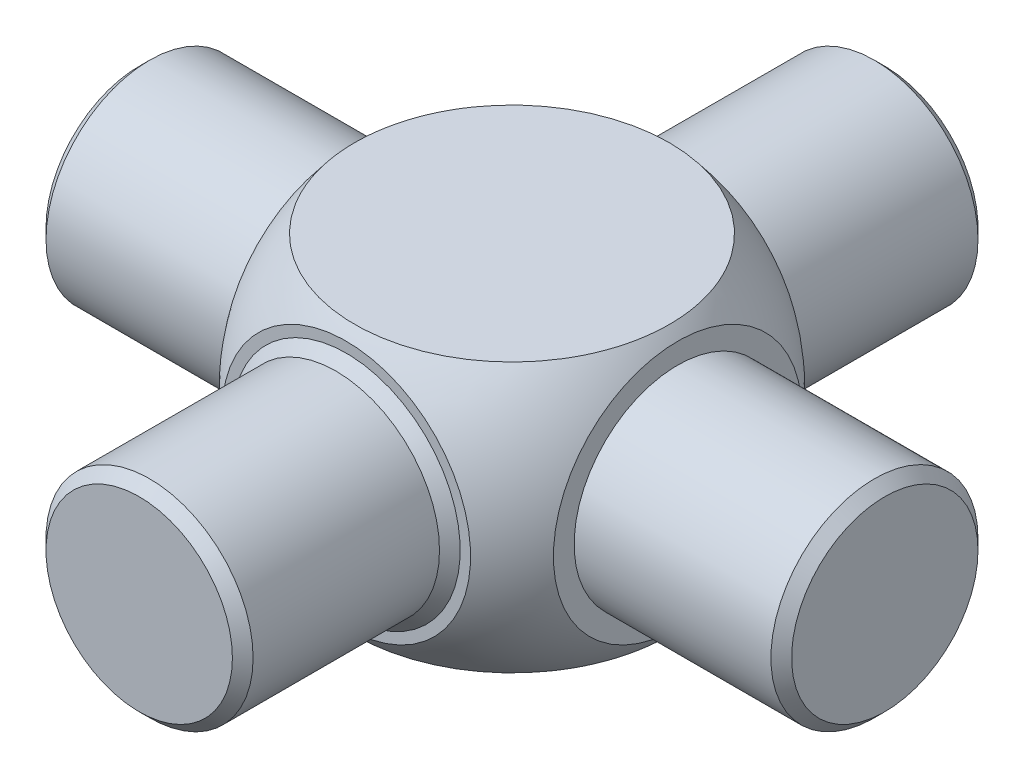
ISO-10303-21;
HEADER;
FILE_DESCRIPTION(('STEP AP214'),'2;1');
FILE_NAME('part.step','',(''),(''),'','','');
FILE_SCHEMA(('AUTOMOTIVE_DESIGN { 1 0 10303 214 1 1 1 1 }'));
ENDSEC;
DATA;
#1=APPLICATION_CONTEXT('core data for automotive mechanical design processes');
#2=APPLICATION_PROTOCOL_DEFINITION('international standard','automotive_design',2000,#1);
#3=PRODUCT_CONTEXT('',#1,'mechanical');
#4=PRODUCT('Part','Part','',(#3));
#5=PRODUCT_RELATED_PRODUCT_CATEGORY('part','',(#4));
#6=PRODUCT_DEFINITION_FORMATION('','',#4);
#7=PRODUCT_DEFINITION_CONTEXT('part definition',#1,'design');
#8=PRODUCT_DEFINITION('design','',#6,#7);
#9=PRODUCT_DEFINITION_SHAPE('','',#8);
#10=(LENGTH_UNIT() NAMED_UNIT(*) SI_UNIT(.MILLI.,.METRE.));
#11=(NAMED_UNIT(*) PLANE_ANGLE_UNIT() SI_UNIT($,.RADIAN.));
#12=(NAMED_UNIT(*) SI_UNIT($,.STERADIAN.) SOLID_ANGLE_UNIT());
#13=UNCERTAINTY_MEASURE_WITH_UNIT(LENGTH_MEASURE(1.E-05),#10,'distance_accuracy_value','');
#14=(GEOMETRIC_REPRESENTATION_CONTEXT(3) GLOBAL_UNCERTAINTY_ASSIGNED_CONTEXT((#13)) GLOBAL_UNIT_ASSIGNED_CONTEXT((#10,
#11,#12)) REPRESENTATION_CONTEXT('',''));
#15=CARTESIAN_POINT('',(0.,0.,0.));
#16=DIRECTION('',(0.,0.,1.));
#17=DIRECTION('',(1.,0.,0.));
#18=AXIS2_PLACEMENT_3D('',#15,#16,#17);
#19=CARTESIAN_POINT('',(0.,0.,0.));
#20=DIRECTION('',(1.,0.,0.));
#21=DIRECTION('',(0.,1.,0.));
#22=AXIS2_PLACEMENT_3D('',#19,#20,#21);
#23=SPHERICAL_SURFACE('',#22,10.);
#24=CARTESIAN_POINT('',(0.,0.,8.00000000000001));
#25=DIRECTION('',(0.,0.,-1.));
#26=DIRECTION('',(-1.,0.,0.));
#27=AXIS2_PLACEMENT_3D('',#24,#25,#26);
#28=CIRCLE('',#27,6.);
#29=CARTESIAN_POINT('',(-6.,0.,8.00000000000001));
#30=VERTEX_POINT('',#29);
#31=EDGE_CURVE('E67',#30,#30,#28,.F.);
#32=ORIENTED_EDGE('',*,*,#31,.F.);
#33=EDGE_LOOP('',(#32));
#34=FACE_BOUND('',#33,.T.);
#35=CARTESIAN_POINT('',(0.,0.,-8.00000000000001));
#36=DIRECTION('',(0.,0.,1.));
#37=DIRECTION('',(1.,0.,0.));
#38=AXIS2_PLACEMENT_3D('',#35,#36,#37);
#39=CIRCLE('',#38,6.);
#40=CARTESIAN_POINT('',(6.,0.,-8.00000000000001));
#41=VERTEX_POINT('',#40);
#42=EDGE_CURVE('E70',#41,#41,#39,.F.);
#43=ORIENTED_EDGE('',*,*,#42,.F.);
#44=EDGE_LOOP('',(#43));
#45=FACE_BOUND('',#44,.T.);
#46=CARTESIAN_POINT('',(0.,6.5,0.));
#47=DIRECTION('',(0.,-1.,0.));
#48=DIRECTION('',(0.,0.,-1.));
#49=AXIS2_PLACEMENT_3D('',#46,#47,#48);
#50=CIRCLE('',#49,7.59934207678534);
#51=CARTESIAN_POINT('',(0.,6.5,-7.59934207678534));
#52=VERTEX_POINT('',#51);
#53=EDGE_CURVE('E74',#52,#52,#50,.F.);
#54=ORIENTED_EDGE('',*,*,#53,.F.);
#55=EDGE_LOOP('',(#54));
#56=FACE_BOUND('',#55,.T.);
#57=CARTESIAN_POINT('',(0.,-6.5,0.));
#58=DIRECTION('',(0.,1.,0.));
#59=DIRECTION('',(0.,0.,1.));
#60=AXIS2_PLACEMENT_3D('',#57,#58,#59);
#61=CIRCLE('',#60,7.59934207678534);
#62=CARTESIAN_POINT('',(0.,-6.5,7.59934207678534));
#63=VERTEX_POINT('',#62);
#64=EDGE_CURVE('E77',#63,#63,#61,.F.);
#65=ORIENTED_EDGE('',*,*,#64,.F.);
#66=EDGE_LOOP('',(#65));
#67=FACE_BOUND('',#66,.T.);
#68=CARTESIAN_POINT('',(-8.00000000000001,0.,0.));
#69=DIRECTION('',(1.,0.,0.));
#70=DIRECTION('',(0.,0.,-1.));
#71=AXIS2_PLACEMENT_3D('',#68,#69,#70);
#72=CIRCLE('',#71,6.00000000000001);
#73=CARTESIAN_POINT('',(-8.00000000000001,0.,-6.00000000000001));
#74=VERTEX_POINT('',#73);
#75=EDGE_CURVE('E66',#74,#74,#72,.T.);
#76=ORIENTED_EDGE('',*,*,#75,.T.);
#77=EDGE_LOOP('',(#76));
#78=FACE_BOUND('',#77,.T.);
#79=CARTESIAN_POINT('',(8.00000000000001,0.,0.));
#80=DIRECTION('',(1.,0.,0.));
#81=DIRECTION('',(0.,0.,-1.));
#82=AXIS2_PLACEMENT_3D('',#79,#80,#81);
#83=CIRCLE('',#82,6.00000000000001);
#84=CARTESIAN_POINT('',(8.00000000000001,0.,-6.00000000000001));
#85=VERTEX_POINT('',#84);
#86=EDGE_CURVE('E80',#85,#85,#83,.T.);
#87=ORIENTED_EDGE('',*,*,#86,.F.);
#88=EDGE_LOOP('',(#87));
#89=FACE_BOUND('',#88,.T.);
#90=ADVANCED_FACE('F29',(#34,#45,#56,#67,#78,#89),#23,.T.);
#91=CARTESIAN_POINT('',(-8.00000000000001,6.00000000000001,0.));
#92=DIRECTION('',(-1.,0.,0.));
#93=DIRECTION('',(0.,0.,1.));
#94=AXIS2_PLACEMENT_3D('',#91,#92,#93);
#95=PLANE('',#94);
#96=CARTESIAN_POINT('',(-8.00000000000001,0.,0.));
#97=DIRECTION('',(1.,0.,0.));
#98=DIRECTION('',(0.,0.,-1.));
#99=AXIS2_PLACEMENT_3D('',#96,#97,#98);
#100=CIRCLE('',#99,5.);
#101=CARTESIAN_POINT('',(-8.00000000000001,0.,-5.));
#102=VERTEX_POINT('',#101);
#103=EDGE_CURVE('E83',#102,#102,#100,.T.);
#104=ORIENTED_EDGE('',*,*,#103,.T.);
#105=EDGE_LOOP('',(#104));
#106=FACE_BOUND('',#105,.T.);
#107=ORIENTED_EDGE('',*,*,#75,.F.);
#108=EDGE_LOOP('',(#107));
#109=FACE_BOUND('',#108,.T.);
#110=ADVANCED_FACE('F114',(#106,#109),#95,.T.);
#111=CARTESIAN_POINT('',(0.,0.,0.));
#112=DIRECTION('',(1.,0.,0.));
#113=DIRECTION('',(0.,0.,-1.));
#114=AXIS2_PLACEMENT_3D('',#111,#112,#113);
#115=CYLINDRICAL_SURFACE('',#114,5.);
#116=CARTESIAN_POINT('',(-17.5,0.,0.));
#117=DIRECTION('',(-1.,0.,0.));
#118=DIRECTION('',(0.,0.,1.));
#119=AXIS2_PLACEMENT_3D('',#116,#117,#118);
#120=CIRCLE('',#119,5.);
#121=CARTESIAN_POINT('',(-17.5,0.,5.));
#122=VERTEX_POINT('',#121);
#123=EDGE_CURVE('E43',#122,#122,#120,.F.);
#124=ORIENTED_EDGE('',*,*,#123,.T.);
#125=EDGE_LOOP('',(#124));
#126=FACE_BOUND('',#125,.T.);
#127=ORIENTED_EDGE('',*,*,#103,.F.);
#128=EDGE_LOOP('',(#127));
#129=FACE_BOUND('',#128,.T.);
#130=ADVANCED_FACE('F119',(#126,#129),#115,.T.);
#131=CARTESIAN_POINT('',(-18.,0.,0.));
#132=DIRECTION('',(-1.,0.,0.));
#133=DIRECTION('',(0.,0.,1.));
#134=AXIS2_PLACEMENT_3D('',#131,#132,#133);
#135=PLANE('',#134);
#136=CARTESIAN_POINT('',(-18.,0.,0.));
#137=DIRECTION('',(-1.,0.,0.));
#138=DIRECTION('',(0.,0.,1.));
#139=AXIS2_PLACEMENT_3D('',#136,#137,#138);
#140=CIRCLE('',#139,4.49999999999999);
#141=CARTESIAN_POINT('',(-18.,0.,4.49999999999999));
#142=VERTEX_POINT('',#141);
#143=EDGE_CURVE('E39',#142,#142,#140,.T.);
#144=ORIENTED_EDGE('',*,*,#143,.T.);
#145=EDGE_LOOP('',(#144));
#146=FACE_BOUND('',#145,.T.);
#147=ADVANCED_FACE('F147',(#146),#135,.T.);
#148=CARTESIAN_POINT('',(18.,0.,0.));
#149=DIRECTION('',(1.,0.,0.));
#150=DIRECTION('',(0.,0.,-1.));
#151=AXIS2_PLACEMENT_3D('',#148,#149,#150);
#152=PLANE('',#151);
#153=CARTESIAN_POINT('',(18.,0.,0.));
#154=DIRECTION('',(1.,0.,0.));
#155=DIRECTION('',(0.,0.,-1.));
#156=AXIS2_PLACEMENT_3D('',#153,#154,#155);
#157=CIRCLE('',#156,4.49999999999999);
#158=CARTESIAN_POINT('',(18.,0.,-4.49999999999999));
#159=VERTEX_POINT('',#158);
#160=EDGE_CURVE('E35',#159,#159,#157,.T.);
#161=ORIENTED_EDGE('',*,*,#160,.T.);
#162=EDGE_LOOP('',(#161));
#163=FACE_BOUND('',#162,.T.);
#164=ADVANCED_FACE('F142',(#163),#152,.T.);
#165=CARTESIAN_POINT('',(0.,0.,0.));
#166=DIRECTION('',(1.,0.,0.));
#167=DIRECTION('',(0.,0.,-1.));
#168=AXIS2_PLACEMENT_3D('',#165,#166,#167);
#169=CYLINDRICAL_SURFACE('',#168,5.);
#170=CARTESIAN_POINT('',(17.5,0.,0.));
#171=DIRECTION('',(1.,0.,0.));
#172=DIRECTION('',(0.,0.,-1.));
#173=AXIS2_PLACEMENT_3D('',#170,#171,#172);
#174=CIRCLE('',#173,5.);
#175=CARTESIAN_POINT('',(17.5,0.,-5.));
#176=VERTEX_POINT('',#175);
#177=EDGE_CURVE('E10',#176,#176,#174,.F.);
#178=ORIENTED_EDGE('',*,*,#177,.T.);
#179=EDGE_LOOP('',(#178));
#180=FACE_BOUND('',#179,.T.);
#181=CARTESIAN_POINT('',(8.00000000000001,0.,0.));
#182=DIRECTION('',(1.,0.,0.));
#183=DIRECTION('',(0.,0.,-1.));
#184=AXIS2_PLACEMENT_3D('',#181,#182,#183);
#185=CIRCLE('',#184,5.);
#186=CARTESIAN_POINT('',(8.00000000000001,0.,-5.));
#187=VERTEX_POINT('',#186);
#188=EDGE_CURVE('E86',#187,#187,#185,.T.);
#189=ORIENTED_EDGE('',*,*,#188,.T.);
#190=EDGE_LOOP('',(#189));
#191=FACE_BOUND('',#190,.T.);
#192=ADVANCED_FACE('F137',(#180,#191),#169,.T.);
#193=CARTESIAN_POINT('',(8.00000000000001,6.00000000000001,0.));
#194=DIRECTION('',(1.,0.,0.));
#195=DIRECTION('',(0.,0.,-1.));
#196=AXIS2_PLACEMENT_3D('',#193,#194,#195);
#197=PLANE('',#196);
#198=ORIENTED_EDGE('',*,*,#86,.T.);
#199=EDGE_LOOP('',(#198));
#200=FACE_BOUND('',#199,.T.);
#201=ORIENTED_EDGE('',*,*,#188,.F.);
#202=EDGE_LOOP('',(#201));
#203=FACE_BOUND('',#202,.T.);
#204=ADVANCED_FACE('F133',(#200,#203),#197,.T.);
#205=CARTESIAN_POINT('',(9.00000000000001,-6.5,-12.5));
#206=DIRECTION('',(0.,1.,0.));
#207=DIRECTION('',(0.,0.,1.));
#208=AXIS2_PLACEMENT_3D('',#205,#206,#207);
#209=PLANE('',#208);
#210=ORIENTED_EDGE('',*,*,#64,.T.);
#211=EDGE_LOOP('',(#210));
#212=FACE_BOUND('',#211,.T.);
#213=ADVANCED_FACE('F136',(#212),#209,.F.);
#214=CARTESIAN_POINT('',(9.00000000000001,6.5,-12.5));
#215=DIRECTION('',(0.,-1.,0.));
#216=DIRECTION('',(0.,0.,-1.));
#217=AXIS2_PLACEMENT_3D('',#214,#215,#216);
#218=PLANE('',#217);
#219=ORIENTED_EDGE('',*,*,#53,.T.);
#220=EDGE_LOOP('',(#219));
#221=FACE_BOUND('',#220,.T.);
#222=ADVANCED_FACE('F200',(#221),#218,.F.);
#223=CARTESIAN_POINT('',(-9.00000000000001,-12.5,-8.00000000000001));
#224=DIRECTION('',(0.,0.,1.));
#225=DIRECTION('',(1.,0.,0.));
#226=AXIS2_PLACEMENT_3D('',#223,#224,#225);
#227=PLANE('',#226);
#228=CARTESIAN_POINT('',(0.,0.,-8.00000000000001));
#229=DIRECTION('',(0.,0.,1.));
#230=DIRECTION('',(1.,0.,0.));
#231=AXIS2_PLACEMENT_3D('',#228,#229,#230);
#232=CIRCLE('',#231,5.);
#233=CARTESIAN_POINT('',(5.,0.,-8.00000000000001));
#234=VERTEX_POINT('',#233);
#235=EDGE_CURVE('E71',#234,#234,#232,.T.);
#236=ORIENTED_EDGE('',*,*,#235,.T.);
#237=EDGE_LOOP('',(#236));
#238=FACE_BOUND('',#237,.T.);
#239=ORIENTED_EDGE('',*,*,#42,.T.);
#240=EDGE_LOOP('',(#239));
#241=FACE_BOUND('',#240,.T.);
#242=ADVANCED_FACE('F94',(#238,#241),#227,.F.);
#243=CARTESIAN_POINT('',(-9.,-12.5,8.00000000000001));
#244=DIRECTION('',(0.,0.,-1.));
#245=DIRECTION('',(-1.,0.,0.));
#246=AXIS2_PLACEMENT_3D('',#243,#244,#245);
#247=PLANE('',#246);
#248=CARTESIAN_POINT('',(0.,0.,8.00000000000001));
#249=DIRECTION('',(0.,0.,-1.));
#250=DIRECTION('',(-1.,0.,0.));
#251=AXIS2_PLACEMENT_3D('',#248,#249,#250);
#252=CIRCLE('',#251,5.50000000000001);
#253=CARTESIAN_POINT('',(-5.50000000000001,0.,8.00000000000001));
#254=VERTEX_POINT('',#253);
#255=EDGE_CURVE('E63',#254,#254,#252,.T.);
#256=ORIENTED_EDGE('',*,*,#255,.T.);
#257=EDGE_LOOP('',(#256));
#258=FACE_BOUND('',#257,.T.);
#259=ORIENTED_EDGE('',*,*,#31,.T.);
#260=EDGE_LOOP('',(#259));
#261=FACE_BOUND('',#260,.T.);
#262=ADVANCED_FACE('F191',(#258,#261),#247,.F.);
#263=CARTESIAN_POINT('',(0.,0.,18.));
#264=DIRECTION('',(0.,0.,1.));
#265=DIRECTION('',(1.,0.,0.));
#266=AXIS2_PLACEMENT_3D('',#263,#264,#265);
#267=PLANE('',#266);
#268=CARTESIAN_POINT('',(0.,0.,18.));
#269=DIRECTION('',(0.,0.,1.));
#270=DIRECTION('',(1.,0.,0.));
#271=AXIS2_PLACEMENT_3D('',#268,#269,#270);
#272=CIRCLE('',#271,4.5);
#273=CARTESIAN_POINT('',(4.5,0.,18.));
#274=VERTEX_POINT('',#273);
#275=EDGE_CURVE('E54',#274,#274,#272,.T.);
#276=ORIENTED_EDGE('',*,*,#275,.T.);
#277=EDGE_LOOP('',(#276));
#278=FACE_BOUND('',#277,.T.);
#279=ADVANCED_FACE('F110',(#278),#267,.T.);
#280=CARTESIAN_POINT('',(0.,0.,0.));
#281=DIRECTION('',(0.,0.,1.));
#282=DIRECTION('',(1.,0.,0.));
#283=AXIS2_PLACEMENT_3D('',#280,#281,#282);
#284=CYLINDRICAL_SURFACE('',#283,5.);
#285=CARTESIAN_POINT('',(0.,0.,8.50000000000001));
#286=DIRECTION('',(0.,0.,-1.));
#287=DIRECTION('',(-1.,0.,0.));
#288=AXIS2_PLACEMENT_3D('',#285,#286,#287);
#289=CIRCLE('',#288,5.);
#290=CARTESIAN_POINT('',(-5.,0.,8.50000000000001));
#291=VERTEX_POINT('',#290);
#292=EDGE_CURVE('E57',#291,#291,#289,.F.);
#293=ORIENTED_EDGE('',*,*,#292,.T.);
#294=EDGE_LOOP('',(#293));
#295=FACE_BOUND('',#294,.T.);
#296=CARTESIAN_POINT('',(0.,0.,17.5));
#297=DIRECTION('',(0.,0.,1.));
#298=DIRECTION('',(1.,0.,0.));
#299=AXIS2_PLACEMENT_3D('',#296,#297,#298);
#300=CIRCLE('',#299,5.);
#301=CARTESIAN_POINT('',(5.,0.,17.5));
#302=VERTEX_POINT('',#301);
#303=EDGE_CURVE('E60',#302,#302,#300,.F.);
#304=ORIENTED_EDGE('',*,*,#303,.T.);
#305=EDGE_LOOP('',(#304));
#306=FACE_BOUND('',#305,.T.);
#307=ADVANCED_FACE('F100',(#295,#306),#284,.T.);
#308=CARTESIAN_POINT('',(0.,0.,-17.5));
#309=DIRECTION('',(0.,0.,-1.));
#310=DIRECTION('',(-1.,0.,0.));
#311=AXIS2_PLACEMENT_3D('',#308,#309,#310);
#312=CIRCLE('',#311,5.);
#313=CARTESIAN_POINT('',(-5.,0.,-17.5));
#314=VERTEX_POINT('',#313);
#315=EDGE_CURVE('E51',#314,#314,#312,.F.);
#316=ORIENTED_EDGE('',*,*,#315,.T.);
#317=EDGE_LOOP('',(#316));
#318=FACE_BOUND('',#317,.T.);
#319=ORIENTED_EDGE('',*,*,#235,.F.);
#320=EDGE_LOOP('',(#319));
#321=FACE_BOUND('',#320,.T.);
#322=ADVANCED_FACE('F97',(#318,#321),#284,.T.);
#323=CARTESIAN_POINT('',(0.,0.,-18.));
#324=DIRECTION('',(0.,0.,-1.));
#325=DIRECTION('',(-1.,0.,0.));
#326=AXIS2_PLACEMENT_3D('',#323,#324,#325);
#327=PLANE('',#326);
#328=CARTESIAN_POINT('',(0.,0.,-18.));
#329=DIRECTION('',(0.,0.,-1.));
#330=DIRECTION('',(-1.,0.,0.));
#331=AXIS2_PLACEMENT_3D('',#328,#329,#330);
#332=CIRCLE('',#331,4.5);
#333=CARTESIAN_POINT('',(-4.5,0.,-18.));
#334=VERTEX_POINT('',#333);
#335=EDGE_CURVE('E48',#334,#334,#332,.T.);
#336=ORIENTED_EDGE('',*,*,#335,.T.);
#337=EDGE_LOOP('',(#336));
#338=FACE_BOUND('',#337,.T.);
#339=ADVANCED_FACE('F99',(#338),#327,.T.);
#340=CARTESIAN_POINT('',(0.,0.,8.00000000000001));
#341=DIRECTION('',(0.,0.,-1.));
#342=DIRECTION('',(-1.,0.,0.));
#343=AXIS2_PLACEMENT_3D('',#340,#341,#342);
#344=CONICAL_SURFACE('',#343,5.50000000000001,0.785398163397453);
#345=ORIENTED_EDGE('',*,*,#292,.F.);
#346=EDGE_LOOP('',(#345));
#347=FACE_BOUND('',#346,.T.);
#348=ORIENTED_EDGE('',*,*,#255,.F.);
#349=EDGE_LOOP('',(#348));
#350=FACE_BOUND('',#349,.T.);
#351=ADVANCED_FACE('F107',(#347,#350),#344,.T.);
#352=CARTESIAN_POINT('',(0.,0.,18.));
#353=DIRECTION('',(0.,0.,-1.));
#354=DIRECTION('',(-1.,0.,0.));
#355=AXIS2_PLACEMENT_3D('',#352,#353,#354);
#356=CONICAL_SURFACE('',#355,4.5,0.785398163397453);
#357=ORIENTED_EDGE('',*,*,#303,.F.);
#358=EDGE_LOOP('',(#357));
#359=FACE_BOUND('',#358,.T.);
#360=ORIENTED_EDGE('',*,*,#275,.F.);
#361=EDGE_LOOP('',(#360));
#362=FACE_BOUND('',#361,.T.);
#363=ADVANCED_FACE('F175',(#359,#362),#356,.T.);
#364=CARTESIAN_POINT('',(0.,0.,-17.5));
#365=DIRECTION('',(0.,0.,1.));
#366=DIRECTION('',(1.,0.,0.));
#367=AXIS2_PLACEMENT_3D('',#364,#365,#366);
#368=CONICAL_SURFACE('',#367,5.,0.785398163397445);
#369=ORIENTED_EDGE('',*,*,#335,.F.);
#370=EDGE_LOOP('',(#369));
#371=FACE_BOUND('',#370,.T.);
#372=ORIENTED_EDGE('',*,*,#315,.F.);
#373=EDGE_LOOP('',(#372));
#374=FACE_BOUND('',#373,.T.);
#375=ADVANCED_FACE('F166',(#371,#374),#368,.T.);
#376=CARTESIAN_POINT('',(-17.5,0.,0.));
#377=DIRECTION('',(1.,0.,0.));
#378=DIRECTION('',(0.,0.,-1.));
#379=AXIS2_PLACEMENT_3D('',#376,#377,#378);
#380=CONICAL_SURFACE('',#379,5.,0.785398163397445);
#381=ORIENTED_EDGE('',*,*,#143,.F.);
#382=EDGE_LOOP('',(#381));
#383=FACE_BOUND('',#382,.T.);
#384=ORIENTED_EDGE('',*,*,#123,.F.);
#385=EDGE_LOOP('',(#384));
#386=FACE_BOUND('',#385,.T.);
#387=ADVANCED_FACE('F163',(#383,#386),#380,.T.);
#388=CARTESIAN_POINT('',(18.,0.,0.));
#389=DIRECTION('',(-1.,0.,0.));
#390=DIRECTION('',(0.,0.,1.));
#391=AXIS2_PLACEMENT_3D('',#388,#389,#390);
#392=CONICAL_SURFACE('',#391,4.49999999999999,0.785398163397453);
#393=ORIENTED_EDGE('',*,*,#177,.F.);
#394=EDGE_LOOP('',(#393));
#395=FACE_BOUND('',#394,.T.);
#396=ORIENTED_EDGE('',*,*,#160,.F.);
#397=EDGE_LOOP('',(#396));
#398=FACE_BOUND('',#397,.T.);
#399=ADVANCED_FACE('F165',(#395,#398),#392,.T.);
#400=CLOSED_SHELL('',(#90,#110,#130,#147,#164,#192,#204,#213,#222,#242,#262,#279,#307,#322,#339,
#351,#363,#375,#387,#399));
#401=MANIFOLD_SOLID_BREP('B2',#400);
#402=ADVANCED_BREP_SHAPE_REPRESENTATION('',(#18,#401),#14);
#403=SHAPE_DEFINITION_REPRESENTATION(#9,#402);
ENDSEC;
END-ISO-10303-21;
